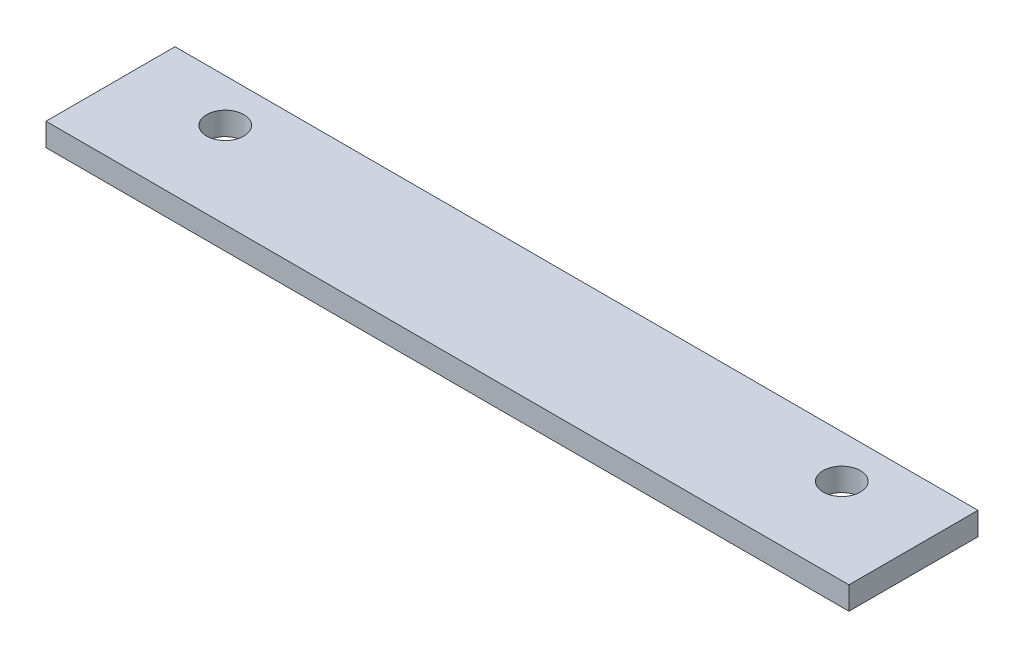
ISO-10303-21;
HEADER;
FILE_DESCRIPTION(('STEP AP214'),'2;1');
FILE_NAME('part.step','',(''),(''),'','','');
FILE_SCHEMA(('AUTOMOTIVE_DESIGN { 1 0 10303 214 1 1 1 1 }'));
ENDSEC;
DATA;
#1=APPLICATION_CONTEXT('core data for automotive mechanical design processes');
#2=APPLICATION_PROTOCOL_DEFINITION('international standard','automotive_design',2000,#1);
#3=PRODUCT_CONTEXT('',#1,'mechanical');
#4=PRODUCT('Part','Part','',(#3));
#5=PRODUCT_RELATED_PRODUCT_CATEGORY('part','',(#4));
#6=PRODUCT_DEFINITION_FORMATION('','',#4);
#7=PRODUCT_DEFINITION_CONTEXT('part definition',#1,'design');
#8=PRODUCT_DEFINITION('design','',#6,#7);
#9=PRODUCT_DEFINITION_SHAPE('','',#8);
#10=(LENGTH_UNIT() NAMED_UNIT(*) SI_UNIT(.MILLI.,.METRE.));
#11=(NAMED_UNIT(*) PLANE_ANGLE_UNIT() SI_UNIT($,.RADIAN.));
#12=(NAMED_UNIT(*) SI_UNIT($,.STERADIAN.) SOLID_ANGLE_UNIT());
#13=UNCERTAINTY_MEASURE_WITH_UNIT(LENGTH_MEASURE(1.E-05),#10,'distance_accuracy_value','');
#14=(GEOMETRIC_REPRESENTATION_CONTEXT(3) GLOBAL_UNCERTAINTY_ASSIGNED_CONTEXT((#13)) GLOBAL_UNIT_ASSIGNED_CONTEXT((#10,
#11,#12)) REPRESENTATION_CONTEXT('',''));
#15=CARTESIAN_POINT('',(0.,0.,0.));
#16=DIRECTION('',(0.,0.,1.));
#17=DIRECTION('',(1.,0.,0.));
#18=AXIS2_PLACEMENT_3D('',#15,#16,#17);
#19=CARTESIAN_POINT('',(0.,16.,0.));
#20=DIRECTION('',(0.,-1.,0.));
#21=DIRECTION('',(0.,0.,-1.));
#22=AXIS2_PLACEMENT_3D('',#19,#20,#21);
#23=PLANE('',#22);
#24=DIRECTION('',(0.,0.,-1.));
#25=VECTOR('',#24,1.);
#26=CARTESIAN_POINT('',(280.,16.,45.0000000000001));
#27=LINE('',#26,#25);
#28=CARTESIAN_POINT('',(280.,16.,45.0000000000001));
#29=VERTEX_POINT('',#28);
#30=CARTESIAN_POINT('',(280.,16.,-44.9999999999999));
#31=VERTEX_POINT('',#30);
#32=EDGE_CURVE('E85',#29,#31,#27,.T.);
#33=ORIENTED_EDGE('',*,*,#32,.T.);
#34=DIRECTION('',(-1.,0.,0.));
#35=VECTOR('',#34,1.);
#36=CARTESIAN_POINT('',(-280.,16.,-44.9999999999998));
#37=LINE('',#36,#35);
#38=CARTESIAN_POINT('',(-280.,16.,-44.9999999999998));
#39=VERTEX_POINT('',#38);
#40=EDGE_CURVE('E80',#31,#39,#37,.T.);
#41=ORIENTED_EDGE('',*,*,#40,.T.);
#42=DIRECTION('',(0.,0.,1.));
#43=VECTOR('',#42,1.);
#44=CARTESIAN_POINT('',(-280.,16.,44.9999999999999));
#45=LINE('',#44,#43);
#46=CARTESIAN_POINT('',(-280.,16.,44.9999999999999));
#47=VERTEX_POINT('',#46);
#48=EDGE_CURVE('E83',#39,#47,#45,.T.);
#49=ORIENTED_EDGE('',*,*,#48,.T.);
#50=DIRECTION('',(1.,0.,0.));
#51=VECTOR('',#50,1.);
#52=CARTESIAN_POINT('',(-280.,16.,44.9999999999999));
#53=LINE('',#52,#51);
#54=EDGE_CURVE('E50',#47,#29,#53,.T.);
#55=ORIENTED_EDGE('',*,*,#54,.T.);
#56=EDGE_LOOP('',(#33,#41,#49,#55));
#57=FACE_BOUND('',#56,.T.);
#58=CARTESIAN_POINT('',(215.,16.,-14.9999999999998));
#59=DIRECTION('',(0.,1.,0.));
#60=DIRECTION('',(0.,0.,1.));
#61=AXIS2_PLACEMENT_3D('',#58,#59,#60);
#62=CIRCLE('',#61,13.0000000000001);
#63=CARTESIAN_POINT('',(215.,16.,-1.99999999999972));
#64=VERTEX_POINT('',#63);
#65=EDGE_CURVE('E100',#64,#64,#62,.T.);
#66=ORIENTED_EDGE('',*,*,#65,.F.);
#67=EDGE_LOOP('',(#66));
#68=FACE_BOUND('',#67,.T.);
#69=CARTESIAN_POINT('',(-215.,16.,-14.9999999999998));
#70=DIRECTION('',(0.,1.,0.));
#71=DIRECTION('',(0.,0.,-1.));
#72=AXIS2_PLACEMENT_3D('',#69,#70,#71);
#73=CIRCLE('',#72,13.);
#74=CARTESIAN_POINT('',(-215.,16.,-27.9999999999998));
#75=VERTEX_POINT('',#74);
#76=EDGE_CURVE('E115',#75,#75,#73,.T.);
#77=ORIENTED_EDGE('',*,*,#76,.F.);
#78=EDGE_LOOP('',(#77));
#79=FACE_BOUND('',#78,.T.);
#80=ADVANCED_FACE('F33',(#57,#68,#79),#23,.F.);
#81=CARTESIAN_POINT('',(0.,0.,0.));
#82=DIRECTION('',(0.,-1.,0.));
#83=DIRECTION('',(0.,0.,-1.));
#84=AXIS2_PLACEMENT_3D('',#81,#82,#83);
#85=PLANE('',#84);
#86=CARTESIAN_POINT('',(215.,0.,-14.9999999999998));
#87=DIRECTION('',(0.,1.,0.));
#88=DIRECTION('',(0.,0.,1.));
#89=AXIS2_PLACEMENT_3D('',#86,#87,#88);
#90=CIRCLE('',#89,13.0000000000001);
#91=CARTESIAN_POINT('',(215.,0.,-1.99999999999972));
#92=VERTEX_POINT('',#91);
#93=EDGE_CURVE('E112',#92,#92,#90,.T.);
#94=ORIENTED_EDGE('',*,*,#93,.T.);
#95=EDGE_LOOP('',(#94));
#96=FACE_BOUND('',#95,.T.);
#97=DIRECTION('',(0.,0.,-1.));
#98=VECTOR('',#97,1.);
#99=CARTESIAN_POINT('',(280.,0.,45.0000000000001));
#100=LINE('',#99,#98);
#101=CARTESIAN_POINT('',(280.,0.,45.0000000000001));
#102=VERTEX_POINT('',#101);
#103=CARTESIAN_POINT('',(280.,0.,-44.9999999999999));
#104=VERTEX_POINT('',#103);
#105=EDGE_CURVE('E97',#102,#104,#100,.T.);
#106=ORIENTED_EDGE('',*,*,#105,.F.);
#107=DIRECTION('',(1.,0.,0.));
#108=VECTOR('',#107,1.);
#109=CARTESIAN_POINT('',(-280.,0.,44.9999999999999));
#110=LINE('',#109,#108);
#111=CARTESIAN_POINT('',(-280.,0.,44.9999999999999));
#112=VERTEX_POINT('',#111);
#113=EDGE_CURVE('E73',#112,#102,#110,.T.);
#114=ORIENTED_EDGE('',*,*,#113,.F.);
#115=DIRECTION('',(0.,0.,1.));
#116=VECTOR('',#115,1.);
#117=CARTESIAN_POINT('',(-280.,0.,44.9999999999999));
#118=LINE('',#117,#116);
#119=CARTESIAN_POINT('',(-280.,0.,-44.9999999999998));
#120=VERTEX_POINT('',#119);
#121=EDGE_CURVE('E67',#120,#112,#118,.T.);
#122=ORIENTED_EDGE('',*,*,#121,.F.);
#123=DIRECTION('',(-1.,0.,0.));
#124=VECTOR('',#123,1.);
#125=CARTESIAN_POINT('',(-280.,0.,-44.9999999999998));
#126=LINE('',#125,#124);
#127=EDGE_CURVE('E89',#104,#120,#126,.T.);
#128=ORIENTED_EDGE('',*,*,#127,.F.);
#129=EDGE_LOOP('',(#106,#114,#122,#128));
#130=FACE_BOUND('',#129,.T.);
#131=CARTESIAN_POINT('',(-215.,0.,-14.9999999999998));
#132=DIRECTION('',(0.,1.,0.));
#133=DIRECTION('',(0.,0.,-1.));
#134=AXIS2_PLACEMENT_3D('',#131,#132,#133);
#135=CIRCLE('',#134,13.);
#136=CARTESIAN_POINT('',(-215.,0.,-27.9999999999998));
#137=VERTEX_POINT('',#136);
#138=EDGE_CURVE('E118',#137,#137,#135,.T.);
#139=ORIENTED_EDGE('',*,*,#138,.T.);
#140=EDGE_LOOP('',(#139));
#141=FACE_BOUND('',#140,.T.);
#142=ADVANCED_FACE('F108',(#96,#130,#141),#85,.T.);
#143=CARTESIAN_POINT('',(280.,16.,45.0000000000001));
#144=DIRECTION('',(-1.,0.,0.));
#145=DIRECTION('',(0.,0.,1.));
#146=AXIS2_PLACEMENT_3D('',#143,#144,#145);
#147=PLANE('',#146);
#148=ORIENTED_EDGE('',*,*,#105,.T.);
#149=DIRECTION('',(0.,-1.,0.));
#150=VECTOR('',#149,1.);
#151=CARTESIAN_POINT('',(280.,16.,-44.9999999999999));
#152=LINE('',#151,#150);
#153=EDGE_CURVE('E11',#31,#104,#152,.T.);
#154=ORIENTED_EDGE('',*,*,#153,.F.);
#155=ORIENTED_EDGE('',*,*,#32,.F.);
#156=DIRECTION('',(0.,-1.,0.));
#157=VECTOR('',#156,1.);
#158=CARTESIAN_POINT('',(280.,16.,45.0000000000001));
#159=LINE('',#158,#157);
#160=EDGE_CURVE('E93',#29,#102,#159,.T.);
#161=ORIENTED_EDGE('',*,*,#160,.T.);
#162=EDGE_LOOP('',(#148,#154,#155,#161));
#163=FACE_BOUND('',#162,.T.);
#164=ADVANCED_FACE('F35',(#163),#147,.F.);
#165=CARTESIAN_POINT('',(-280.,16.,-44.9999999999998));
#166=DIRECTION('',(0.,0.,1.));
#167=DIRECTION('',(1.,0.,0.));
#168=AXIS2_PLACEMENT_3D('',#165,#166,#167);
#169=PLANE('',#168);
#170=ORIENTED_EDGE('',*,*,#127,.T.);
#171=DIRECTION('',(0.,-1.,0.));
#172=VECTOR('',#171,1.);
#173=CARTESIAN_POINT('',(-280.,16.,-44.9999999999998));
#174=LINE('',#173,#172);
#175=EDGE_CURVE('E42',#39,#120,#174,.T.);
#176=ORIENTED_EDGE('',*,*,#175,.F.);
#177=ORIENTED_EDGE('',*,*,#40,.F.);
#178=ORIENTED_EDGE('',*,*,#153,.T.);
#179=EDGE_LOOP('',(#170,#176,#177,#178));
#180=FACE_BOUND('',#179,.T.);
#181=ADVANCED_FACE('F88',(#180),#169,.F.);
#182=CARTESIAN_POINT('',(-280.,16.,44.9999999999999));
#183=DIRECTION('',(1.,0.,0.));
#184=DIRECTION('',(0.,0.,-1.));
#185=AXIS2_PLACEMENT_3D('',#182,#183,#184);
#186=PLANE('',#185);
#187=ORIENTED_EDGE('',*,*,#121,.T.);
#188=DIRECTION('',(0.,-1.,0.));
#189=VECTOR('',#188,1.);
#190=CARTESIAN_POINT('',(-280.,16.,44.9999999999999));
#191=LINE('',#190,#189);
#192=EDGE_CURVE('E90',#47,#112,#191,.T.);
#193=ORIENTED_EDGE('',*,*,#192,.F.);
#194=ORIENTED_EDGE('',*,*,#48,.F.);
#195=ORIENTED_EDGE('',*,*,#175,.T.);
#196=EDGE_LOOP('',(#187,#193,#194,#195));
#197=FACE_BOUND('',#196,.T.);
#198=ADVANCED_FACE('F91',(#197),#186,.F.);
#199=CARTESIAN_POINT('',(-280.,16.,44.9999999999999));
#200=DIRECTION('',(0.,0.,-1.));
#201=DIRECTION('',(-1.,0.,0.));
#202=AXIS2_PLACEMENT_3D('',#199,#200,#201);
#203=PLANE('',#202);
#204=ORIENTED_EDGE('',*,*,#113,.T.);
#205=ORIENTED_EDGE('',*,*,#160,.F.);
#206=ORIENTED_EDGE('',*,*,#54,.F.);
#207=ORIENTED_EDGE('',*,*,#192,.T.);
#208=EDGE_LOOP('',(#204,#205,#206,#207));
#209=FACE_BOUND('',#208,.T.);
#210=ADVANCED_FACE('F105',(#209),#203,.F.);
#211=CARTESIAN_POINT('',(215.,16.,-14.9999999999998));
#212=DIRECTION('',(0.,-1.,0.));
#213=DIRECTION('',(0.,0.,-1.));
#214=AXIS2_PLACEMENT_3D('',#211,#212,#213);
#215=CYLINDRICAL_SURFACE('',#214,13.0000000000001);
#216=ORIENTED_EDGE('',*,*,#65,.T.);
#217=EDGE_LOOP('',(#216));
#218=FACE_BOUND('',#217,.T.);
#219=ORIENTED_EDGE('',*,*,#93,.F.);
#220=EDGE_LOOP('',(#219));
#221=FACE_BOUND('',#220,.T.);
#222=ADVANCED_FACE('F135',(#218,#221),#215,.F.);
#223=CARTESIAN_POINT('',(-215.,16.,-14.9999999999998));
#224=DIRECTION('',(0.,-1.,0.));
#225=DIRECTION('',(0.,0.,-1.));
#226=AXIS2_PLACEMENT_3D('',#223,#224,#225);
#227=CYLINDRICAL_SURFACE('',#226,13.);
#228=ORIENTED_EDGE('',*,*,#76,.T.);
#229=EDGE_LOOP('',(#228));
#230=FACE_BOUND('',#229,.T.);
#231=ORIENTED_EDGE('',*,*,#138,.F.);
#232=EDGE_LOOP('',(#231));
#233=FACE_BOUND('',#232,.T.);
#234=ADVANCED_FACE('F124',(#230,#233),#227,.F.);
#235=CLOSED_SHELL('',(#80,#142,#164,#181,#198,#210,#222,#234));
#236=MANIFOLD_SOLID_BREP('B2',#235);
#237=ADVANCED_BREP_SHAPE_REPRESENTATION('',(#18,#236),#14);
#238=SHAPE_DEFINITION_REPRESENTATION(#9,#237);
ENDSEC;
END-ISO-10303-21;
